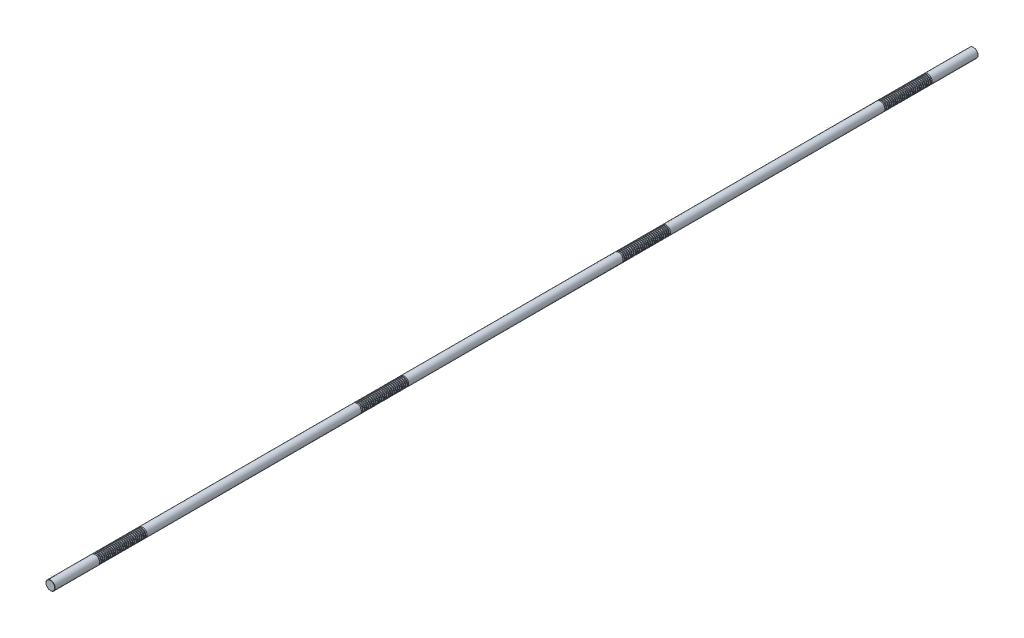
from build123d import *

# Parameters (mm, degrees)
SKETCH1_R           = 10
BOSS_EXTRUDE1_DEPTH = 1000
CHAMFER1_SIZE       = 0.5
LPATTERN1_COUNT     = 26
LPATTERN1_PITCH     = 4
LPATTERN2_COUNT     = 4
LPATTERN2_PITCH     = 567


with BuildPart() as part:
    # Sketch1 → Boss-Extrude1 (new, symmetric)
    with BuildSketch(Plane.XY):
        Circle(SKETCH1_R)
    extrude(amount=BOSS_EXTRUDE1_DEPTH, both=True)

    # Chamfer1
    chamfer1_edges = [part.edges().sort_by_distance(p)[0] for p in [
        (-10, 0, -1000),
        (-10, 0, 1000),
    ]]
    chamfer(chamfer1_edges, length=CHAMFER1_SIZE)

    # Sketch2 → Cut-Revolve1 (revolve, cut)
    with BuildSketch(Plane(origin=(0, 0, 0), x_dir=(0, 0, -1), z_dir=(1, 0, 0)), mode=Mode.PRIVATE) as cut_revolve1_sk:
        Polygon((900.301442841, 10), (897.698557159, 10), (898.301442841, 7.75), (899.698557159, 7.75), align=None)
    cut_revolve1 = revolve(cut_revolve1_sk.sketch.rotate(Axis((0, 0, 1000), (0, 0, -1)), 90), axis=Axis((0, 0, 1000), (0, 0, -1)), mode=Mode.SUBTRACT)

    # LPattern1: Cut-Revolve1 ×26
    with Locations(*[(0, 0, i * LPATTERN1_PITCH) for i in range(1, LPATTERN1_COUNT)]):
        add(cut_revolve1, mode=Mode.SUBTRACT)

    # LPattern2: Cut-Revolve1 ×4
    with Locations(*[(0, 0, i * LPATTERN2_PITCH) for i in range(1, LPATTERN2_COUNT)]):
        add(cut_revolve1, mode=Mode.SUBTRACT)

    # LPattern2 copy 1 sketch → LPattern2 copy 1 (revolve, cut)
    with BuildSketch(Plane(origin=(0, 0, 571), x_dir=(0, 0, -1), z_dir=(1, 0, 0))):
        Polygon((900.301442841, 10), (897.698557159, 10), (898.301442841, 7.75), (899.698557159, 7.75), align=None)
    revolve(axis=Axis((0, 0, 1571), (0, 0, -1)), mode=Mode.SUBTRACT)

    # LPattern2 copy 2 sketch → LPattern2 copy 2 (revolve, cut)
    with BuildSketch(Plane(origin=(0, 0, 1138), x_dir=(0, 0, -1), z_dir=(1, 0, 0))):
        Polygon((900.301442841, 10), (897.698557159, 10), (898.301442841, 7.75), (899.698557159, 7.75), align=None)
    revolve(axis=Axis((0, 0, 2138), (0, 0, -1)), mode=Mode.SUBTRACT)

    # LPattern2 copy 3 sketch → LPattern2 copy 3 (revolve, cut)
    with BuildSketch(Plane(origin=(0, 0, 1705), x_dir=(0, 0, -1), z_dir=(1, 0, 0))):
        Polygon((900.301442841, 10), (897.698557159, 10), (898.301442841, 7.75), (899.698557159, 7.75), align=None)
    revolve(axis=Axis((0, 0, 2705), (0, 0, -1)), mode=Mode.SUBTRACT)

    # LPattern2 copy 4 sketch → LPattern2 copy 4 (revolve, cut)
    with BuildSketch(Plane(origin=(0, 0, 575), x_dir=(0, 0, -1), z_dir=(1, 0, 0))):
        Polygon((900.301442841, 10), (897.698557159, 10), (898.301442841, 7.75), (899.698557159, 7.75), align=None)
    revolve(axis=Axis((0, 0, 1575), (0, 0, -1)), mode=Mode.SUBTRACT)

    # LPattern2 copy 5 sketch → LPattern2 copy 5 (revolve, cut)
    with BuildSketch(Plane(origin=(0, 0, 1142), x_dir=(0, 0, -1), z_dir=(1, 0, 0))):
        Polygon((900.301442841, 10), (897.698557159, 10), (898.301442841, 7.75), (899.698557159, 7.75), align=None)
    revolve(axis=Axis((0, 0, 2142), (0, 0, -1)), mode=Mode.SUBTRACT)

    # LPattern2 copy 6 sketch → LPattern2 copy 6 (revolve, cut)
    with BuildSketch(Plane(origin=(0, 0, 1709), x_dir=(0, 0, -1), z_dir=(1, 0, 0))):
        Polygon((900.301442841, 10), (897.698557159, 10), (898.301442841, 7.75), (899.698557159, 7.75), align=None)
    revolve(axis=Axis((0, 0, 2709), (0, 0, -1)), mode=Mode.SUBTRACT)

    # LPattern2 copy 7 sketch → LPattern2 copy 7 (revolve, cut)
    with BuildSketch(Plane(origin=(0, 0, 579), x_dir=(0, 0, -1), z_dir=(1, 0, 0))):
        Polygon((900.301442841, 10), (897.698557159, 10), (898.301442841, 7.75), (899.698557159, 7.75), align=None)
    revolve(axis=Axis((0, 0, 1579), (0, 0, -1)), mode=Mode.SUBTRACT)

    # LPattern2 copy 8 sketch → LPattern2 copy 8 (revolve, cut)
    with BuildSketch(Plane(origin=(0, 0, 1146), x_dir=(0, 0, -1), z_dir=(1, 0, 0))):
        Polygon((900.301442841, 10), (897.698557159, 10), (898.301442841, 7.75), (899.698557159, 7.75), align=None)
    revolve(axis=Axis((0, 0, 2146), (0, 0, -1)), mode=Mode.SUBTRACT)

    # LPattern2 copy 9 sketch → LPattern2 copy 9 (revolve, cut)
    with BuildSketch(Plane(origin=(0, 0, 1713), x_dir=(0, 0, -1), z_dir=(1, 0, 0))):
        Polygon((900.301442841, 10), (897.698557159, 10), (898.301442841, 7.75), (899.698557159, 7.75), align=None)
    revolve(axis=Axis((0, 0, 2713), (0, 0, -1)), mode=Mode.SUBTRACT)

    # LPattern2 copy 10 sketch → LPattern2 copy 10 (revolve, cut)
    with BuildSketch(Plane(origin=(0, 0, 583), x_dir=(0, 0, -1), z_dir=(1, 0, 0))):
        Polygon((900.301442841, 10), (897.698557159, 10), (898.301442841, 7.75), (899.698557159, 7.75), align=None)
    revolve(axis=Axis((0, 0, 1583), (0, 0, -1)), mode=Mode.SUBTRACT)

    # LPattern2 copy 11 sketch → LPattern2 copy 11 (revolve, cut)
    with BuildSketch(Plane(origin=(0, 0, 1150), x_dir=(0, 0, -1), z_dir=(1, 0, 0))):
        Polygon((900.301442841, 10), (897.698557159, 10), (898.301442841, 7.75), (899.698557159, 7.75), align=None)
    revolve(axis=Axis((0, 0, 2150), (0, 0, -1)), mode=Mode.SUBTRACT)

    # LPattern2 copy 12 sketch → LPattern2 copy 12 (revolve, cut)
    with BuildSketch(Plane(origin=(0, 0, 1717), x_dir=(0, 0, -1), z_dir=(1, 0, 0))):
        Polygon((900.301442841, 10), (897.698557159, 10), (898.301442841, 7.75), (899.698557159, 7.75), align=None)
    revolve(axis=Axis((0, 0, 2717), (0, 0, -1)), mode=Mode.SUBTRACT)

    # LPattern2 copy 13 sketch → LPattern2 copy 13 (revolve, cut)
    with BuildSketch(Plane(origin=(0, 0, 587), x_dir=(0, 0, -1), z_dir=(1, 0, 0))):
        Polygon((900.301442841, 10), (897.698557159, 10), (898.301442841, 7.75), (899.698557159, 7.75), align=None)
    revolve(axis=Axis((0, 0, 1587), (0, 0, -1)), mode=Mode.SUBTRACT)

    # LPattern2 copy 14 sketch → LPattern2 copy 14 (revolve, cut)
    with BuildSketch(Plane(origin=(0, 0, 1154), x_dir=(0, 0, -1), z_dir=(1, 0, 0))):
        Polygon((900.301442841, 10), (897.698557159, 10), (898.301442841, 7.75), (899.698557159, 7.75), align=None)
    revolve(axis=Axis((0, 0, 2154), (0, 0, -1)), mode=Mode.SUBTRACT)

    # LPattern2 copy 15 sketch → LPattern2 copy 15 (revolve, cut)
    with BuildSketch(Plane(origin=(0, 0, 1721), x_dir=(0, 0, -1), z_dir=(1, 0, 0))):
        Polygon((900.301442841, 10), (897.698557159, 10), (898.301442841, 7.75), (899.698557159, 7.75), align=None)
    revolve(axis=Axis((0, 0, 2721), (0, 0, -1)), mode=Mode.SUBTRACT)

    # LPattern2 copy 16 sketch → LPattern2 copy 16 (revolve, cut)
    with BuildSketch(Plane(origin=(0, 0, 591), x_dir=(0, 0, -1), z_dir=(1, 0, 0))):
        Polygon((900.301442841, 10), (897.698557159, 10), (898.301442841, 7.75), (899.698557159, 7.75), align=None)
    revolve(axis=Axis((0, 0, 1591), (0, 0, -1)), mode=Mode.SUBTRACT)

    # LPattern2 copy 17 sketch → LPattern2 copy 17 (revolve, cut)
    with BuildSketch(Plane(origin=(0, 0, 1158), x_dir=(0, 0, -1), z_dir=(1, 0, 0))):
        Polygon((900.301442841, 10), (897.698557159, 10), (898.301442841, 7.75), (899.698557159, 7.75), align=None)
    revolve(axis=Axis((0, 0, 2158), (0, 0, -1)), mode=Mode.SUBTRACT)

    # LPattern2 copy 18 sketch → LPattern2 copy 18 (revolve, cut)
    with BuildSketch(Plane(origin=(0, 0, 1725), x_dir=(0, 0, -1), z_dir=(1, 0, 0))):
        Polygon((900.301442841, 10), (897.698557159, 10), (898.301442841, 7.75), (899.698557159, 7.75), align=None)
    revolve(axis=Axis((0, 0, 2725), (0, 0, -1)), mode=Mode.SUBTRACT)

    # LPattern2 copy 19 sketch → LPattern2 copy 19 (revolve, cut)
    with BuildSketch(Plane(origin=(0, 0, 595), x_dir=(0, 0, -1), z_dir=(1, 0, 0))):
        Polygon((900.301442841, 10), (897.698557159, 10), (898.301442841, 7.75), (899.698557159, 7.75), align=None)
    revolve(axis=Axis((0, 0, 1595), (0, 0, -1)), mode=Mode.SUBTRACT)

    # LPattern2 copy 20 sketch → LPattern2 copy 20 (revolve, cut)
    with BuildSketch(Plane(origin=(0, 0, 1162), x_dir=(0, 0, -1), z_dir=(1, 0, 0))):
        Polygon((900.301442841, 10), (897.698557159, 10), (898.301442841, 7.75), (899.698557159, 7.75), align=None)
    revolve(axis=Axis((0, 0, 2162), (0, 0, -1)), mode=Mode.SUBTRACT)

    # LPattern2 copy 21 sketch → LPattern2 copy 21 (revolve, cut)
    with BuildSketch(Plane(origin=(0, 0, 1729), x_dir=(0, 0, -1), z_dir=(1, 0, 0))):
        Polygon((900.301442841, 10), (897.698557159, 10), (898.301442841, 7.75), (899.698557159, 7.75), align=None)
    revolve(axis=Axis((0, 0, 2729), (0, 0, -1)), mode=Mode.SUBTRACT)

    # LPattern2 copy 22 sketch → LPattern2 copy 22 (revolve, cut)
    with BuildSketch(Plane(origin=(0, 0, 599), x_dir=(0, 0, -1), z_dir=(1, 0, 0))):
        Polygon((900.301442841, 10), (897.698557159, 10), (898.301442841, 7.75), (899.698557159, 7.75), align=None)
    revolve(axis=Axis((0, 0, 1599), (0, 0, -1)), mode=Mode.SUBTRACT)

    # LPattern2 copy 23 sketch → LPattern2 copy 23 (revolve, cut)
    with BuildSketch(Plane(origin=(0, 0, 1166), x_dir=(0, 0, -1), z_dir=(1, 0, 0))):
        Polygon((900.301442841, 10), (897.698557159, 10), (898.301442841, 7.75), (899.698557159, 7.75), align=None)
    revolve(axis=Axis((0, 0, 2166), (0, 0, -1)), mode=Mode.SUBTRACT)

    # LPattern2 copy 24 sketch → LPattern2 copy 24 (revolve, cut)
    with BuildSketch(Plane(origin=(0, 0, 1733), x_dir=(0, 0, -1), z_dir=(1, 0, 0))):
        Polygon((900.301442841, 10), (897.698557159, 10), (898.301442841, 7.75), (899.698557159, 7.75), align=None)
    revolve(axis=Axis((0, 0, 2733), (0, 0, -1)), mode=Mode.SUBTRACT)

    # LPattern2 copy 25 sketch → LPattern2 copy 25 (revolve, cut)
    with BuildSketch(Plane(origin=(0, 0, 603), x_dir=(0, 0, -1), z_dir=(1, 0, 0))):
        Polygon((900.301442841, 10), (897.698557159, 10), (898.301442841, 7.75), (899.698557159, 7.75), align=None)
    revolve(axis=Axis((0, 0, 1603), (0, 0, -1)), mode=Mode.SUBTRACT)

    # LPattern2 copy 26 sketch → LPattern2 copy 26 (revolve, cut)
    with BuildSketch(Plane(origin=(0, 0, 1170), x_dir=(0, 0, -1), z_dir=(1, 0, 0))):
        Polygon((900.301442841, 10), (897.698557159, 10), (898.301442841, 7.75), (899.698557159, 7.75), align=None)
    revolve(axis=Axis((0, 0, 2170), (0, 0, -1)), mode=Mode.SUBTRACT)

    # LPattern2 copy 27 sketch → LPattern2 copy 27 (revolve, cut)
    with BuildSketch(Plane(origin=(0, 0, 1737), x_dir=(0, 0, -1), z_dir=(1, 0, 0))):
        Polygon((900.301442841, 10), (897.698557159, 10), (898.301442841, 7.75), (899.698557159, 7.75), align=None)
    revolve(axis=Axis((0, 0, 2737), (0, 0, -1)), mode=Mode.SUBTRACT)

    # LPattern2 copy 28 sketch → LPattern2 copy 28 (revolve, cut)
    with BuildSketch(Plane(origin=(0, 0, 607), x_dir=(0, 0, -1), z_dir=(1, 0, 0))):
        Polygon((900.301442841, 10), (897.698557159, 10), (898.301442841, 7.75), (899.698557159, 7.75), align=None)
    revolve(axis=Axis((0, 0, 1607), (0, 0, -1)), mode=Mode.SUBTRACT)

    # LPattern2 copy 29 sketch → LPattern2 copy 29 (revolve, cut)
    with BuildSketch(Plane(origin=(0, 0, 1174), x_dir=(0, 0, -1), z_dir=(1, 0, 0))):
        Polygon((900.301442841, 10), (897.698557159, 10), (898.301442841, 7.75), (899.698557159, 7.75), align=None)
    revolve(axis=Axis((0, 0, 2174), (0, 0, -1)), mode=Mode.SUBTRACT)

    # LPattern2 copy 30 sketch → LPattern2 copy 30 (revolve, cut)
    with BuildSketch(Plane(origin=(0, 0, 1741), x_dir=(0, 0, -1), z_dir=(1, 0, 0))):
        Polygon((900.301442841, 10), (897.698557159, 10), (898.301442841, 7.75), (899.698557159, 7.75), align=None)
    revolve(axis=Axis((0, 0, 2741), (0, 0, -1)), mode=Mode.SUBTRACT)

    # LPattern2 copy 31 sketch → LPattern2 copy 31 (revolve, cut)
    with BuildSketch(Plane(origin=(0, 0, 611), x_dir=(0, 0, -1), z_dir=(1, 0, 0))):
        Polygon((900.301442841, 10), (897.698557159, 10), (898.301442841, 7.75), (899.698557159, 7.75), align=None)
    revolve(axis=Axis((0, 0, 1611), (0, 0, -1)), mode=Mode.SUBTRACT)

    # LPattern2 copy 32 sketch → LPattern2 copy 32 (revolve, cut)
    with BuildSketch(Plane(origin=(0, 0, 1178), x_dir=(0, 0, -1), z_dir=(1, 0, 0))):
        Polygon((900.301442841, 10), (897.698557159, 10), (898.301442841, 7.75), (899.698557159, 7.75), align=None)
    revolve(axis=Axis((0, 0, 2178), (0, 0, -1)), mode=Mode.SUBTRACT)

    # LPattern2 copy 33 sketch → LPattern2 copy 33 (revolve, cut)
    with BuildSketch(Plane(origin=(0, 0, 1745), x_dir=(0, 0, -1), z_dir=(1, 0, 0))):
        Polygon((900.301442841, 10), (897.698557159, 10), (898.301442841, 7.75), (899.698557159, 7.75), align=None)
    revolve(axis=Axis((0, 0, 2745), (0, 0, -1)), mode=Mode.SUBTRACT)

    # LPattern2 copy 34 sketch → LPattern2 copy 34 (revolve, cut)
    with BuildSketch(Plane(origin=(0, 0, 615), x_dir=(0, 0, -1), z_dir=(1, 0, 0))):
        Polygon((900.301442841, 10), (897.698557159, 10), (898.301442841, 7.75), (899.698557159, 7.75), align=None)
    revolve(axis=Axis((0, 0, 1615), (0, 0, -1)), mode=Mode.SUBTRACT)

    # LPattern2 copy 35 sketch → LPattern2 copy 35 (revolve, cut)
    with BuildSketch(Plane(origin=(0, 0, 1182), x_dir=(0, 0, -1), z_dir=(1, 0, 0))):
        Polygon((900.301442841, 10), (897.698557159, 10), (898.301442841, 7.75), (899.698557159, 7.75), align=None)
    revolve(axis=Axis((0, 0, 2182), (0, 0, -1)), mode=Mode.SUBTRACT)

    # LPattern2 copy 36 sketch → LPattern2 copy 36 (revolve, cut)
    with BuildSketch(Plane(origin=(0, 0, 1749), x_dir=(0, 0, -1), z_dir=(1, 0, 0))):
        Polygon((900.301442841, 10), (897.698557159, 10), (898.301442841, 7.75), (899.698557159, 7.75), align=None)
    revolve(axis=Axis((0, 0, 2749), (0, 0, -1)), mode=Mode.SUBTRACT)

    # LPattern2 copy 37 sketch → LPattern2 copy 37 (revolve, cut)
    with BuildSketch(Plane(origin=(0, 0, 619), x_dir=(0, 0, -1), z_dir=(1, 0, 0))):
        Polygon((900.301442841, 10), (897.698557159, 10), (898.301442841, 7.75), (899.698557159, 7.75), align=None)
    revolve(axis=Axis((0, 0, 1619), (0, 0, -1)), mode=Mode.SUBTRACT)

    # LPattern2 copy 38 sketch → LPattern2 copy 38 (revolve, cut)
    with BuildSketch(Plane(origin=(0, 0, 1186), x_dir=(0, 0, -1), z_dir=(1, 0, 0))):
        Polygon((900.301442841, 10), (897.698557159, 10), (898.301442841, 7.75), (899.698557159, 7.75), align=None)
    revolve(axis=Axis((0, 0, 2186), (0, 0, -1)), mode=Mode.SUBTRACT)

    # LPattern2 copy 39 sketch → LPattern2 copy 39 (revolve, cut)
    with BuildSketch(Plane(origin=(0, 0, 1753), x_dir=(0, 0, -1), z_dir=(1, 0, 0))):
        Polygon((900.301442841, 10), (897.698557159, 10), (898.301442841, 7.75), (899.698557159, 7.75), align=None)
    revolve(axis=Axis((0, 0, 2753), (0, 0, -1)), mode=Mode.SUBTRACT)

    # LPattern2 copy 40 sketch → LPattern2 copy 40 (revolve, cut)
    with BuildSketch(Plane(origin=(0, 0, 623), x_dir=(0, 0, -1), z_dir=(1, 0, 0))):
        Polygon((900.301442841, 10), (897.698557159, 10), (898.301442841, 7.75), (899.698557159, 7.75), align=None)
    revolve(axis=Axis((0, 0, 1623), (0, 0, -1)), mode=Mode.SUBTRACT)

    # LPattern2 copy 41 sketch → LPattern2 copy 41 (revolve, cut)
    with BuildSketch(Plane(origin=(0, 0, 1190), x_dir=(0, 0, -1), z_dir=(1, 0, 0))):
        Polygon((900.301442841, 10), (897.698557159, 10), (898.301442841, 7.75), (899.698557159, 7.75), align=None)
    revolve(axis=Axis((0, 0, 2190), (0, 0, -1)), mode=Mode.SUBTRACT)

    # LPattern2 copy 42 sketch → LPattern2 copy 42 (revolve, cut)
    with BuildSketch(Plane(origin=(0, 0, 1757), x_dir=(0, 0, -1), z_dir=(1, 0, 0))):
        Polygon((900.301442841, 10), (897.698557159, 10), (898.301442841, 7.75), (899.698557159, 7.75), align=None)
    revolve(axis=Axis((0, 0, 2757), (0, 0, -1)), mode=Mode.SUBTRACT)

    # LPattern2 copy 43 sketch → LPattern2 copy 43 (revolve, cut)
    with BuildSketch(Plane(origin=(0, 0, 627), x_dir=(0, 0, -1), z_dir=(1, 0, 0))):
        Polygon((900.301442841, 10), (897.698557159, 10), (898.301442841, 7.75), (899.698557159, 7.75), align=None)
    revolve(axis=Axis((0, 0, 1627), (0, 0, -1)), mode=Mode.SUBTRACT)

    # LPattern2 copy 44 sketch → LPattern2 copy 44 (revolve, cut)
    with BuildSketch(Plane(origin=(0, 0, 1194), x_dir=(0, 0, -1), z_dir=(1, 0, 0))):
        Polygon((900.301442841, 10), (897.698557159, 10), (898.301442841, 7.75), (899.698557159, 7.75), align=None)
    revolve(axis=Axis((0, 0, 2194), (0, 0, -1)), mode=Mode.SUBTRACT)

    # LPattern2 copy 45 sketch → LPattern2 copy 45 (revolve, cut)
    with BuildSketch(Plane(origin=(0, 0, 1761), x_dir=(0, 0, -1), z_dir=(1, 0, 0))):
        Polygon((900.301442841, 10), (897.698557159, 10), (898.301442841, 7.75), (899.698557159, 7.75), align=None)
    revolve(axis=Axis((0, 0, 2761), (0, 0, -1)), mode=Mode.SUBTRACT)

    # LPattern2 copy 46 sketch → LPattern2 copy 46 (revolve, cut)
    with BuildSketch(Plane(origin=(0, 0, 631), x_dir=(0, 0, -1), z_dir=(1, 0, 0))):
        Polygon((900.301442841, 10), (897.698557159, 10), (898.301442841, 7.75), (899.698557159, 7.75), align=None)
    revolve(axis=Axis((0, 0, 1631), (0, 0, -1)), mode=Mode.SUBTRACT)

    # LPattern2 copy 47 sketch → LPattern2 copy 47 (revolve, cut)
    with BuildSketch(Plane(origin=(0, 0, 1198), x_dir=(0, 0, -1), z_dir=(1, 0, 0))):
        Polygon((900.301442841, 10), (897.698557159, 10), (898.301442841, 7.75), (899.698557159, 7.75), align=None)
    revolve(axis=Axis((0, 0, 2198), (0, 0, -1)), mode=Mode.SUBTRACT)

    # LPattern2 copy 48 sketch → LPattern2 copy 48 (revolve, cut)
    with BuildSketch(Plane(origin=(0, 0, 1765), x_dir=(0, 0, -1), z_dir=(1, 0, 0))):
        Polygon((900.301442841, 10), (897.698557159, 10), (898.301442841, 7.75), (899.698557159, 7.75), align=None)
    revolve(axis=Axis((0, 0, 2765), (0, 0, -1)), mode=Mode.SUBTRACT)

    # LPattern2 copy 49 sketch → LPattern2 copy 49 (revolve, cut)
    with BuildSketch(Plane(origin=(0, 0, 635), x_dir=(0, 0, -1), z_dir=(1, 0, 0))):
        Polygon((900.301442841, 10), (897.698557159, 10), (898.301442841, 7.75), (899.698557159, 7.75), align=None)
    revolve(axis=Axis((0, 0, 1635), (0, 0, -1)), mode=Mode.SUBTRACT)

    # LPattern2 copy 50 sketch → LPattern2 copy 50 (revolve, cut)
    with BuildSketch(Plane(origin=(0, 0, 1202), x_dir=(0, 0, -1), z_dir=(1, 0, 0))):
        Polygon((900.301442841, 10), (897.698557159, 10), (898.301442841, 7.75), (899.698557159, 7.75), align=None)
    revolve(axis=Axis((0, 0, 2202), (0, 0, -1)), mode=Mode.SUBTRACT)

    # LPattern2 copy 51 sketch → LPattern2 copy 51 (revolve, cut)
    with BuildSketch(Plane(origin=(0, 0, 1769), x_dir=(0, 0, -1), z_dir=(1, 0, 0))):
        Polygon((900.301442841, 10), (897.698557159, 10), (898.301442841, 7.75), (899.698557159, 7.75), align=None)
    revolve(axis=Axis((0, 0, 2769), (0, 0, -1)), mode=Mode.SUBTRACT)

    # LPattern2 copy 52 sketch → LPattern2 copy 52 (revolve, cut)
    with BuildSketch(Plane(origin=(0, 0, 639), x_dir=(0, 0, -1), z_dir=(1, 0, 0))):
        Polygon((900.301442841, 10), (897.698557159, 10), (898.301442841, 7.75), (899.698557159, 7.75), align=None)
    revolve(axis=Axis((0, 0, 1639), (0, 0, -1)), mode=Mode.SUBTRACT)

    # LPattern2 copy 53 sketch → LPattern2 copy 53 (revolve, cut)
    with BuildSketch(Plane(origin=(0, 0, 1206), x_dir=(0, 0, -1), z_dir=(1, 0, 0))):
        Polygon((900.301442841, 10), (897.698557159, 10), (898.301442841, 7.75), (899.698557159, 7.75), align=None)
    revolve(axis=Axis((0, 0, 2206), (0, 0, -1)), mode=Mode.SUBTRACT)

    # LPattern2 copy 54 sketch → LPattern2 copy 54 (revolve, cut)
    with BuildSketch(Plane(origin=(0, 0, 1773), x_dir=(0, 0, -1), z_dir=(1, 0, 0))):
        Polygon((900.301442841, 10), (897.698557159, 10), (898.301442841, 7.75), (899.698557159, 7.75), align=None)
    revolve(axis=Axis((0, 0, 2773), (0, 0, -1)), mode=Mode.SUBTRACT)

    # LPattern2 copy 55 sketch → LPattern2 copy 55 (revolve, cut)
    with BuildSketch(Plane(origin=(0, 0, 643), x_dir=(0, 0, -1), z_dir=(1, 0, 0))):
        Polygon((900.301442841, 10), (897.698557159, 10), (898.301442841, 7.75), (899.698557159, 7.75), align=None)
    revolve(axis=Axis((0, 0, 1643), (0, 0, -1)), mode=Mode.SUBTRACT)

    # LPattern2 copy 56 sketch → LPattern2 copy 56 (revolve, cut)
    with BuildSketch(Plane(origin=(0, 0, 1210), x_dir=(0, 0, -1), z_dir=(1, 0, 0))):
        Polygon((900.301442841, 10), (897.698557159, 10), (898.301442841, 7.75), (899.698557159, 7.75), align=None)
    revolve(axis=Axis((0, 0, 2210), (0, 0, -1)), mode=Mode.SUBTRACT)

    # LPattern2 copy 57 sketch → LPattern2 copy 57 (revolve, cut)
    with BuildSketch(Plane(origin=(0, 0, 1777), x_dir=(0, 0, -1), z_dir=(1, 0, 0))):
        Polygon((900.301442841, 10), (897.698557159, 10), (898.301442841, 7.75), (899.698557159, 7.75), align=None)
    revolve(axis=Axis((0, 0, 2777), (0, 0, -1)), mode=Mode.SUBTRACT)

    # LPattern2 copy 58 sketch → LPattern2 copy 58 (revolve, cut)
    with BuildSketch(Plane(origin=(0, 0, 647), x_dir=(0, 0, -1), z_dir=(1, 0, 0))):
        Polygon((900.301442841, 10), (897.698557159, 10), (898.301442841, 7.75), (899.698557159, 7.75), align=None)
    revolve(axis=Axis((0, 0, 1647), (0, 0, -1)), mode=Mode.SUBTRACT)

    # LPattern2 copy 59 sketch → LPattern2 copy 59 (revolve, cut)
    with BuildSketch(Plane(origin=(0, 0, 1214), x_dir=(0, 0, -1), z_dir=(1, 0, 0))):
        Polygon((900.301442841, 10), (897.698557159, 10), (898.301442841, 7.75), (899.698557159, 7.75), align=None)
    revolve(axis=Axis((0, 0, 2214), (0, 0, -1)), mode=Mode.SUBTRACT)

    # LPattern2 copy 60 sketch → LPattern2 copy 60 (revolve, cut)
    with BuildSketch(Plane(origin=(0, 0, 1781), x_dir=(0, 0, -1), z_dir=(1, 0, 0))):
        Polygon((900.301442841, 10), (897.698557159, 10), (898.301442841, 7.75), (899.698557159, 7.75), align=None)
    revolve(axis=Axis((0, 0, 2781), (0, 0, -1)), mode=Mode.SUBTRACT)

    # LPattern2 copy 61 sketch → LPattern2 copy 61 (revolve, cut)
    with BuildSketch(Plane(origin=(0, 0, 651), x_dir=(0, 0, -1), z_dir=(1, 0, 0))):
        Polygon((900.301442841, 10), (897.698557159, 10), (898.301442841, 7.75), (899.698557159, 7.75), align=None)
    revolve(axis=Axis((0, 0, 1651), (0, 0, -1)), mode=Mode.SUBTRACT)

    # LPattern2 copy 62 sketch → LPattern2 copy 62 (revolve, cut)
    with BuildSketch(Plane(origin=(0, 0, 1218), x_dir=(0, 0, -1), z_dir=(1, 0, 0))):
        Polygon((900.301442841, 10), (897.698557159, 10), (898.301442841, 7.75), (899.698557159, 7.75), align=None)
    revolve(axis=Axis((0, 0, 2218), (0, 0, -1)), mode=Mode.SUBTRACT)

    # LPattern2 copy 63 sketch → LPattern2 copy 63 (revolve, cut)
    with BuildSketch(Plane(origin=(0, 0, 1785), x_dir=(0, 0, -1), z_dir=(1, 0, 0))):
        Polygon((900.301442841, 10), (897.698557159, 10), (898.301442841, 7.75), (899.698557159, 7.75), align=None)
    revolve(axis=Axis((0, 0, 2785), (0, 0, -1)), mode=Mode.SUBTRACT)

    # LPattern2 copy 64 sketch → LPattern2 copy 64 (revolve, cut)
    with BuildSketch(Plane(origin=(0, 0, 655), x_dir=(0, 0, -1), z_dir=(1, 0, 0))):
        Polygon((900.301442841, 10), (897.698557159, 10), (898.301442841, 7.75), (899.698557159, 7.75), align=None)
    revolve(axis=Axis((0, 0, 1655), (0, 0, -1)), mode=Mode.SUBTRACT)

    # LPattern2 copy 65 sketch → LPattern2 copy 65 (revolve, cut)
    with BuildSketch(Plane(origin=(0, 0, 1222), x_dir=(0, 0, -1), z_dir=(1, 0, 0))):
        Polygon((900.301442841, 10), (897.698557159, 10), (898.301442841, 7.75), (899.698557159, 7.75), align=None)
    revolve(axis=Axis((0, 0, 2222), (0, 0, -1)), mode=Mode.SUBTRACT)

    # LPattern2 copy 66 sketch → LPattern2 copy 66 (revolve, cut)
    with BuildSketch(Plane(origin=(0, 0, 1789), x_dir=(0, 0, -1), z_dir=(1, 0, 0))):
        Polygon((900.301442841, 10), (897.698557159, 10), (898.301442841, 7.75), (899.698557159, 7.75), align=None)
    revolve(axis=Axis((0, 0, 2789), (0, 0, -1)), mode=Mode.SUBTRACT)

    # LPattern2 copy 67 sketch → LPattern2 copy 67 (revolve, cut)
    with BuildSketch(Plane(origin=(0, 0, 659), x_dir=(0, 0, -1), z_dir=(1, 0, 0))):
        Polygon((900.301442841, 10), (897.698557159, 10), (898.301442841, 7.75), (899.698557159, 7.75), align=None)
    revolve(axis=Axis((0, 0, 1659), (0, 0, -1)), mode=Mode.SUBTRACT)

    # LPattern2 copy 68 sketch → LPattern2 copy 68 (revolve, cut)
    with BuildSketch(Plane(origin=(0, 0, 1226), x_dir=(0, 0, -1), z_dir=(1, 0, 0))):
        Polygon((900.301442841, 10), (897.698557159, 10), (898.301442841, 7.75), (899.698557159, 7.75), align=None)
    revolve(axis=Axis((0, 0, 2226), (0, 0, -1)), mode=Mode.SUBTRACT)

    # LPattern2 copy 69 sketch → LPattern2 copy 69 (revolve, cut)
    with BuildSketch(Plane(origin=(0, 0, 1793), x_dir=(0, 0, -1), z_dir=(1, 0, 0))):
        Polygon((900.301442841, 10), (897.698557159, 10), (898.301442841, 7.75), (899.698557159, 7.75), align=None)
    revolve(axis=Axis((0, 0, 2793), (0, 0, -1)), mode=Mode.SUBTRACT)

    # LPattern2 copy 70 sketch → LPattern2 copy 70 (revolve, cut)
    with BuildSketch(Plane(origin=(0, 0, 663), x_dir=(0, 0, -1), z_dir=(1, 0, 0))):
        Polygon((900.301442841, 10), (897.698557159, 10), (898.301442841, 7.75), (899.698557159, 7.75), align=None)
    revolve(axis=Axis((0, 0, 1663), (0, 0, -1)), mode=Mode.SUBTRACT)

    # LPattern2 copy 71 sketch → LPattern2 copy 71 (revolve, cut)
    with BuildSketch(Plane(origin=(0, 0, 1230), x_dir=(0, 0, -1), z_dir=(1, 0, 0))):
        Polygon((900.301442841, 10), (897.698557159, 10), (898.301442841, 7.75), (899.698557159, 7.75), align=None)
    revolve(axis=Axis((0, 0, 2230), (0, 0, -1)), mode=Mode.SUBTRACT)

    # LPattern2 copy 72 sketch → LPattern2 copy 72 (revolve, cut)
    with BuildSketch(Plane(origin=(0, 0, 1797), x_dir=(0, 0, -1), z_dir=(1, 0, 0))):
        Polygon((900.301442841, 10), (897.698557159, 10), (898.301442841, 7.75), (899.698557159, 7.75), align=None)
    revolve(axis=Axis((0, 0, 2797), (0, 0, -1)), mode=Mode.SUBTRACT)

    # LPattern2 copy 73 sketch → LPattern2 copy 73 (revolve, cut)
    with BuildSketch(Plane(origin=(0, 0, 667), x_dir=(0, 0, -1), z_dir=(1, 0, 0))):
        Polygon((900.301442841, 10), (897.698557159, 10), (898.301442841, 7.75), (899.698557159, 7.75), align=None)
    revolve(axis=Axis((0, 0, 1667), (0, 0, -1)), mode=Mode.SUBTRACT)

    # LPattern2 copy 74 sketch → LPattern2 copy 74 (revolve, cut)
    with BuildSketch(Plane(origin=(0, 0, 1234), x_dir=(0, 0, -1), z_dir=(1, 0, 0))):
        Polygon((900.301442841, 10), (897.698557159, 10), (898.301442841, 7.75), (899.698557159, 7.75), align=None)
    revolve(axis=Axis((0, 0, 2234), (0, 0, -1)), mode=Mode.SUBTRACT)

    # LPattern2 copy 75 sketch → LPattern2 copy 75 (revolve, cut)
    with BuildSketch(Plane(origin=(0, 0, 1801), x_dir=(0, 0, -1), z_dir=(1, 0, 0))):
        Polygon((900.301442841, 10), (897.698557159, 10), (898.301442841, 7.75), (899.698557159, 7.75), align=None)
    revolve(axis=Axis((0, 0, 2801), (0, 0, -1)), mode=Mode.SUBTRACT)


solid = part.part
